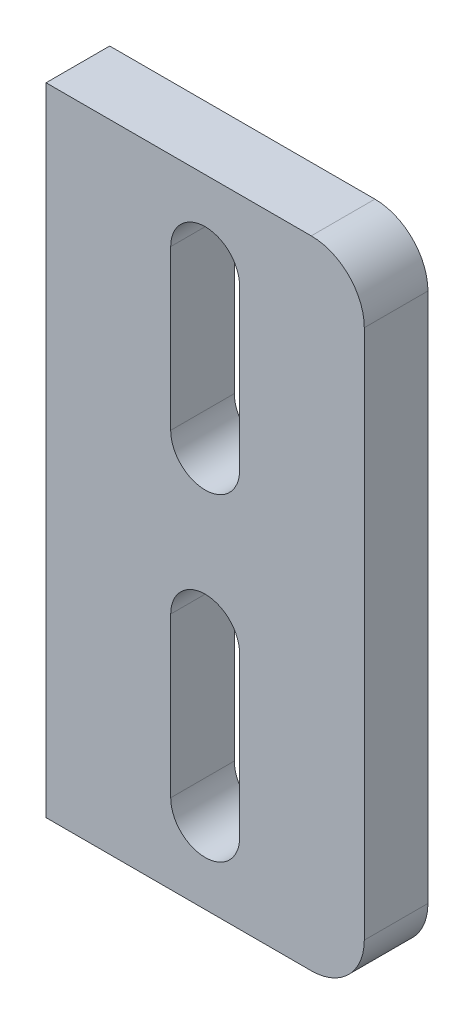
ISO-10303-21;
HEADER;
FILE_DESCRIPTION(('STEP AP214'),'2;1');
FILE_NAME('part.step','',(''),(''),'','','');
FILE_SCHEMA(('AUTOMOTIVE_DESIGN { 1 0 10303 214 1 1 1 1 }'));
ENDSEC;
DATA;
#1=APPLICATION_CONTEXT('core data for automotive mechanical design processes');
#2=APPLICATION_PROTOCOL_DEFINITION('international standard','automotive_design',2000,#1);
#3=PRODUCT_CONTEXT('',#1,'mechanical');
#4=PRODUCT('Part','Part','',(#3));
#5=PRODUCT_RELATED_PRODUCT_CATEGORY('part','',(#4));
#6=PRODUCT_DEFINITION_FORMATION('','',#4);
#7=PRODUCT_DEFINITION_CONTEXT('part definition',#1,'design');
#8=PRODUCT_DEFINITION('design','',#6,#7);
#9=PRODUCT_DEFINITION_SHAPE('','',#8);
#10=(LENGTH_UNIT() NAMED_UNIT(*) SI_UNIT(.MILLI.,.METRE.));
#11=(NAMED_UNIT(*) PLANE_ANGLE_UNIT() SI_UNIT($,.RADIAN.));
#12=(NAMED_UNIT(*) SI_UNIT($,.STERADIAN.) SOLID_ANGLE_UNIT());
#13=UNCERTAINTY_MEASURE_WITH_UNIT(LENGTH_MEASURE(1.E-05),#10,'distance_accuracy_value','');
#14=(GEOMETRIC_REPRESENTATION_CONTEXT(3) GLOBAL_UNCERTAINTY_ASSIGNED_CONTEXT((#13)) GLOBAL_UNIT_ASSIGNED_CONTEXT((#10,
#11,#12)) REPRESENTATION_CONTEXT('',''));
#15=CARTESIAN_POINT('',(0.,0.,0.));
#16=DIRECTION('',(0.,0.,1.));
#17=DIRECTION('',(1.,0.,0.));
#18=AXIS2_PLACEMENT_3D('',#15,#16,#17);
#19=CARTESIAN_POINT('',(20.,-50.,-12.));
#20=DIRECTION('',(0.,0.,1.));
#21=DIRECTION('',(1.,0.,0.));
#22=AXIS2_PLACEMENT_3D('',#19,#20,#21);
#23=CYLINDRICAL_SURFACE('',#22,9.99999999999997);
#24=CARTESIAN_POINT('',(20.,-50.,0.));
#25=DIRECTION('',(0.,0.,1.));
#26=DIRECTION('',(1.,0.,0.));
#27=AXIS2_PLACEMENT_3D('',#24,#25,#26);
#28=CIRCLE('',#27,9.99999999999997);
#29=CARTESIAN_POINT('',(20.,-60.0000000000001,0.));
#30=VERTEX_POINT('',#29);
#31=CARTESIAN_POINT('',(29.9999999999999,-49.9999999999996,0.));
#32=VERTEX_POINT('',#31);
#33=EDGE_CURVE('E214',#30,#32,#28,.T.);
#34=ORIENTED_EDGE('',*,*,#33,.F.);
#35=DIRECTION('',(0.,0.,1.));
#36=VECTOR('',#35,1.);
#37=CARTESIAN_POINT('',(20.,-60.0000000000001,-12.));
#38=LINE('',#37,#36);
#39=CARTESIAN_POINT('',(20.,-60.0000000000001,-12.));
#40=VERTEX_POINT('',#39);
#41=EDGE_CURVE('E11',#40,#30,#38,.T.);
#42=ORIENTED_EDGE('',*,*,#41,.F.);
#43=CARTESIAN_POINT('',(20.,-50.,-12.));
#44=DIRECTION('',(0.,0.,1.));
#45=DIRECTION('',(1.,0.,0.));
#46=AXIS2_PLACEMENT_3D('',#43,#44,#45);
#47=CIRCLE('',#46,9.99999999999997);
#48=CARTESIAN_POINT('',(29.9999999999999,-49.9999999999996,-12.));
#49=VERTEX_POINT('',#48);
#50=EDGE_CURVE('E221',#40,#49,#47,.T.);
#51=ORIENTED_EDGE('',*,*,#50,.T.);
#52=DIRECTION('',(0.,0.,1.));
#53=VECTOR('',#52,1.);
#54=CARTESIAN_POINT('',(29.9999999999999,-49.9999999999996,-12.));
#55=LINE('',#54,#53);
#56=EDGE_CURVE('E50',#49,#32,#55,.T.);
#57=ORIENTED_EDGE('',*,*,#56,.T.);
#58=EDGE_LOOP('',(#34,#42,#51,#57));
#59=FACE_BOUND('',#58,.T.);
#60=ADVANCED_FACE('F47',(#59),#23,.T.);
#61=CARTESIAN_POINT('',(-29.9999999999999,-60.0000000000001,-12.));
#62=DIRECTION('',(0.,-1.,0.));
#63=DIRECTION('',(0.,0.,-1.));
#64=AXIS2_PLACEMENT_3D('',#61,#62,#63);
#65=PLANE('',#64);
#66=DIRECTION('',(1.,0.,0.));
#67=VECTOR('',#66,1.);
#68=CARTESIAN_POINT('',(-29.9999999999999,-60.0000000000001,0.));
#69=LINE('',#68,#67);
#70=CARTESIAN_POINT('',(-29.9999999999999,-60.0000000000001,0.));
#71=VERTEX_POINT('',#70);
#72=EDGE_CURVE('E225',#71,#30,#69,.T.);
#73=ORIENTED_EDGE('',*,*,#72,.F.);
#74=DIRECTION('',(0.,0.,1.));
#75=VECTOR('',#74,1.);
#76=CARTESIAN_POINT('',(-29.9999999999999,-60.0000000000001,-12.));
#77=LINE('',#76,#75);
#78=CARTESIAN_POINT('',(-29.9999999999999,-60.0000000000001,-12.));
#79=VERTEX_POINT('',#78);
#80=EDGE_CURVE('E55',#79,#71,#77,.T.);
#81=ORIENTED_EDGE('',*,*,#80,.F.);
#82=DIRECTION('',(1.,0.,0.));
#83=VECTOR('',#82,1.);
#84=CARTESIAN_POINT('',(-29.9999999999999,-60.0000000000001,-12.));
#85=LINE('',#84,#83);
#86=EDGE_CURVE('E237',#79,#40,#85,.T.);
#87=ORIENTED_EDGE('',*,*,#86,.T.);
#88=ORIENTED_EDGE('',*,*,#41,.T.);
#89=EDGE_LOOP('',(#73,#81,#87,#88));
#90=FACE_BOUND('',#89,.T.);
#91=ADVANCED_FACE('F275',(#90),#65,.T.);
#92=CARTESIAN_POINT('',(-30.,60.0000000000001,-12.));
#93=DIRECTION('',(-1.,0.,0.));
#94=DIRECTION('',(0.,-1.,0.));
#95=AXIS2_PLACEMENT_3D('',#92,#93,#94);
#96=PLANE('',#95);
#97=DIRECTION('',(0.,-1.,0.));
#98=VECTOR('',#97,1.);
#99=CARTESIAN_POINT('',(-30.,60.0000000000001,0.));
#100=LINE('',#99,#98);
#101=CARTESIAN_POINT('',(-30.,60.0000000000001,0.));
#102=VERTEX_POINT('',#101);
#103=EDGE_CURVE('E252',#102,#71,#100,.T.);
#104=ORIENTED_EDGE('',*,*,#103,.F.);
#105=DIRECTION('',(0.,0.,1.));
#106=VECTOR('',#105,1.);
#107=CARTESIAN_POINT('',(-30.,60.0000000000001,-12.));
#108=LINE('',#107,#106);
#109=CARTESIAN_POINT('',(-30.,60.0000000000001,-12.));
#110=VERTEX_POINT('',#109);
#111=EDGE_CURVE('E258',#110,#102,#108,.T.);
#112=ORIENTED_EDGE('',*,*,#111,.F.);
#113=DIRECTION('',(0.,-1.,0.));
#114=VECTOR('',#113,1.);
#115=CARTESIAN_POINT('',(-30.,60.0000000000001,-12.));
#116=LINE('',#115,#114);
#117=EDGE_CURVE('E234',#110,#79,#116,.T.);
#118=ORIENTED_EDGE('',*,*,#117,.T.);
#119=ORIENTED_EDGE('',*,*,#80,.T.);
#120=EDGE_LOOP('',(#104,#112,#118,#119));
#121=FACE_BOUND('',#120,.T.);
#122=ADVANCED_FACE('F287',(#121),#96,.T.);
#123=CARTESIAN_POINT('',(20.,60.0000000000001,-12.));
#124=DIRECTION('',(0.,1.,0.));
#125=DIRECTION('',(0.,0.,1.));
#126=AXIS2_PLACEMENT_3D('',#123,#124,#125);
#127=PLANE('',#126);
#128=DIRECTION('',(-1.,0.,0.));
#129=VECTOR('',#128,1.);
#130=CARTESIAN_POINT('',(20.,60.0000000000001,0.));
#131=LINE('',#130,#129);
#132=CARTESIAN_POINT('',(20.,60.,0.));
#133=VERTEX_POINT('',#132);
#134=EDGE_CURVE('E249',#133,#102,#131,.T.);
#135=ORIENTED_EDGE('',*,*,#134,.F.);
#136=DIRECTION('',(0.,0.,1.));
#137=VECTOR('',#136,1.);
#138=CARTESIAN_POINT('',(20.,60.,-12.));
#139=LINE('',#138,#137);
#140=CARTESIAN_POINT('',(20.,60.,-12.));
#141=VERTEX_POINT('',#140);
#142=EDGE_CURVE('E260',#141,#133,#139,.T.);
#143=ORIENTED_EDGE('',*,*,#142,.F.);
#144=DIRECTION('',(-1.,0.,0.));
#145=VECTOR('',#144,1.);
#146=CARTESIAN_POINT('',(20.,60.0000000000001,-12.));
#147=LINE('',#146,#145);
#148=EDGE_CURVE('E231',#141,#110,#147,.T.);
#149=ORIENTED_EDGE('',*,*,#148,.T.);
#150=ORIENTED_EDGE('',*,*,#111,.T.);
#151=EDGE_LOOP('',(#135,#143,#149,#150));
#152=FACE_BOUND('',#151,.T.);
#153=ADVANCED_FACE('F285',(#152),#127,.T.);
#154=CARTESIAN_POINT('',(20.,50.,-12.));
#155=DIRECTION('',(0.,0.,1.));
#156=DIRECTION('',(1.,0.,0.));
#157=AXIS2_PLACEMENT_3D('',#154,#155,#156);
#158=CYLINDRICAL_SURFACE('',#157,9.99999999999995);
#159=CARTESIAN_POINT('',(20.,50.,0.));
#160=DIRECTION('',(0.,0.,1.));
#161=DIRECTION('',(1.,0.,0.));
#162=AXIS2_PLACEMENT_3D('',#159,#160,#161);
#163=CIRCLE('',#162,9.99999999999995);
#164=CARTESIAN_POINT('',(29.9999999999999,50.,0.));
#165=VERTEX_POINT('',#164);
#166=EDGE_CURVE('E245',#165,#133,#163,.T.);
#167=ORIENTED_EDGE('',*,*,#166,.F.);
#168=DIRECTION('',(0.,0.,1.));
#169=VECTOR('',#168,1.);
#170=CARTESIAN_POINT('',(29.9999999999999,50.,-12.));
#171=LINE('',#170,#169);
#172=CARTESIAN_POINT('',(29.9999999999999,50.,-12.));
#173=VERTEX_POINT('',#172);
#174=EDGE_CURVE('E261',#173,#165,#171,.T.);
#175=ORIENTED_EDGE('',*,*,#174,.F.);
#176=CARTESIAN_POINT('',(20.,50.,-12.));
#177=DIRECTION('',(0.,0.,1.));
#178=DIRECTION('',(1.,0.,0.));
#179=AXIS2_PLACEMENT_3D('',#176,#177,#178);
#180=CIRCLE('',#179,9.99999999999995);
#181=EDGE_CURVE('E228',#173,#141,#180,.T.);
#182=ORIENTED_EDGE('',*,*,#181,.T.);
#183=ORIENTED_EDGE('',*,*,#142,.T.);
#184=EDGE_LOOP('',(#167,#175,#182,#183));
#185=FACE_BOUND('',#184,.T.);
#186=ADVANCED_FACE('F282',(#185),#158,.T.);
#187=CARTESIAN_POINT('',(29.9999999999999,-49.9999999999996,-12.));
#188=DIRECTION('',(1.,0.,0.));
#189=DIRECTION('',(0.,1.,0.));
#190=AXIS2_PLACEMENT_3D('',#187,#188,#189);
#191=PLANE('',#190);
#192=DIRECTION('',(0.,1.,0.));
#193=VECTOR('',#192,1.);
#194=CARTESIAN_POINT('',(29.9999999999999,-49.9999999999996,0.));
#195=LINE('',#194,#193);
#196=EDGE_CURVE('E242',#32,#165,#195,.T.);
#197=ORIENTED_EDGE('',*,*,#196,.F.);
#198=ORIENTED_EDGE('',*,*,#56,.F.);
#199=DIRECTION('',(0.,1.,0.));
#200=VECTOR('',#199,1.);
#201=CARTESIAN_POINT('',(29.9999999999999,-49.9999999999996,-12.));
#202=LINE('',#201,#200);
#203=EDGE_CURVE('E224',#49,#173,#202,.T.);
#204=ORIENTED_EDGE('',*,*,#203,.T.);
#205=ORIENTED_EDGE('',*,*,#174,.T.);
#206=EDGE_LOOP('',(#197,#198,#204,#205));
#207=FACE_BOUND('',#206,.T.);
#208=ADVANCED_FACE('F269',(#207),#191,.T.);
#209=CARTESIAN_POINT('',(20.,-50.,-12.));
#210=DIRECTION('',(0.,0.,1.));
#211=DIRECTION('',(1.,0.,0.));
#212=AXIS2_PLACEMENT_3D('',#209,#210,#211);
#213=PLANE('',#212);
#214=DIRECTION('',(0.,1.,0.));
#215=VECTOR('',#214,1.);
#216=CARTESIAN_POINT('',(6.50000000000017,-44.9999999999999,-12.));
#217=LINE('',#216,#215);
#218=CARTESIAN_POINT('',(6.50000000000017,-44.9999999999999,-12.));
#219=VERTEX_POINT('',#218);
#220=CARTESIAN_POINT('',(6.50000000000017,-15.0000000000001,-12.));
#221=VERTEX_POINT('',#220);
#222=EDGE_CURVE('E157',#219,#221,#217,.T.);
#223=ORIENTED_EDGE('',*,*,#222,.T.);
#224=CARTESIAN_POINT('',(0.,-15.0000000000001,-12.));
#225=DIRECTION('',(0.,0.,1.));
#226=DIRECTION('',(1.,0.,0.));
#227=AXIS2_PLACEMENT_3D('',#224,#225,#226);
#228=CIRCLE('',#227,6.50000000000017);
#229=CARTESIAN_POINT('',(-6.50000000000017,-15.0000000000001,-12.));
#230=VERTEX_POINT('',#229);
#231=EDGE_CURVE('E151',#221,#230,#228,.T.);
#232=ORIENTED_EDGE('',*,*,#231,.T.);
#233=DIRECTION('',(0.,-1.,0.));
#234=VECTOR('',#233,1.);
#235=CARTESIAN_POINT('',(-6.50000000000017,-15.0000000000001,-12.));
#236=LINE('',#235,#234);
#237=CARTESIAN_POINT('',(-6.50000000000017,-44.9999999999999,-12.));
#238=VERTEX_POINT('',#237);
#239=EDGE_CURVE('E160',#230,#238,#236,.T.);
#240=ORIENTED_EDGE('',*,*,#239,.T.);
#241=CARTESIAN_POINT('',(0.,-44.9999999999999,-12.));
#242=DIRECTION('',(0.,0.,1.));
#243=DIRECTION('',(1.,0.,0.));
#244=AXIS2_PLACEMENT_3D('',#241,#242,#243);
#245=CIRCLE('',#244,6.50000000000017);
#246=EDGE_CURVE('E63',#238,#219,#245,.T.);
#247=ORIENTED_EDGE('',*,*,#246,.T.);
#248=EDGE_LOOP('',(#223,#232,#240,#247));
#249=FACE_BOUND('',#248,.T.);
#250=DIRECTION('',(0.,1.,0.));
#251=VECTOR('',#250,1.);
#252=CARTESIAN_POINT('',(6.50000000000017,15.0000000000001,-12.));
#253=LINE('',#252,#251);
#254=CARTESIAN_POINT('',(6.50000000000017,15.0000000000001,-12.));
#255=VERTEX_POINT('',#254);
#256=CARTESIAN_POINT('',(6.50000000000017,44.9999999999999,-12.));
#257=VERTEX_POINT('',#256);
#258=EDGE_CURVE('E197',#255,#257,#253,.T.);
#259=ORIENTED_EDGE('',*,*,#258,.T.);
#260=CARTESIAN_POINT('',(0.,44.9999999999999,-12.));
#261=DIRECTION('',(0.,0.,1.));
#262=DIRECTION('',(1.,0.,0.));
#263=AXIS2_PLACEMENT_3D('',#260,#261,#262);
#264=CIRCLE('',#263,6.50000000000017);
#265=CARTESIAN_POINT('',(-6.50000000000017,44.9999999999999,-12.));
#266=VERTEX_POINT('',#265);
#267=EDGE_CURVE('E186',#257,#266,#264,.T.);
#268=ORIENTED_EDGE('',*,*,#267,.T.);
#269=DIRECTION('',(0.,-1.,0.));
#270=VECTOR('',#269,1.);
#271=CARTESIAN_POINT('',(-6.50000000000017,44.9999999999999,-12.));
#272=LINE('',#271,#270);
#273=CARTESIAN_POINT('',(-6.50000000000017,15.0000000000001,-12.));
#274=VERTEX_POINT('',#273);
#275=EDGE_CURVE('E190',#266,#274,#272,.T.);
#276=ORIENTED_EDGE('',*,*,#275,.T.);
#277=CARTESIAN_POINT('',(0.,15.0000000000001,-12.));
#278=DIRECTION('',(0.,0.,1.));
#279=DIRECTION('',(1.,0.,0.));
#280=AXIS2_PLACEMENT_3D('',#277,#278,#279);
#281=CIRCLE('',#280,6.50000000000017);
#282=EDGE_CURVE('E194',#274,#255,#281,.T.);
#283=ORIENTED_EDGE('',*,*,#282,.T.);
#284=EDGE_LOOP('',(#259,#268,#276,#283));
#285=FACE_BOUND('',#284,.T.);
#286=ORIENTED_EDGE('',*,*,#50,.F.);
#287=ORIENTED_EDGE('',*,*,#86,.F.);
#288=ORIENTED_EDGE('',*,*,#117,.F.);
#289=ORIENTED_EDGE('',*,*,#148,.F.);
#290=ORIENTED_EDGE('',*,*,#181,.F.);
#291=ORIENTED_EDGE('',*,*,#203,.F.);
#292=EDGE_LOOP('',(#286,#287,#288,#289,#290,#291));
#293=FACE_BOUND('',#292,.T.);
#294=ADVANCED_FACE('F164',(#249,#285,#293),#213,.F.);
#295=CARTESIAN_POINT('',(20.,-50.,0.));
#296=DIRECTION('',(0.,0.,1.));
#297=DIRECTION('',(1.,0.,0.));
#298=AXIS2_PLACEMENT_3D('',#295,#296,#297);
#299=PLANE('',#298);
#300=CARTESIAN_POINT('',(0.,-15.0000000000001,0.));
#301=DIRECTION('',(0.,0.,1.));
#302=DIRECTION('',(1.,0.,0.));
#303=AXIS2_PLACEMENT_3D('',#300,#301,#302);
#304=CIRCLE('',#303,6.50000000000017);
#305=CARTESIAN_POINT('',(6.50000000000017,-15.0000000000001,0.));
#306=VERTEX_POINT('',#305);
#307=CARTESIAN_POINT('',(-6.50000000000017,-15.0000000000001,0.));
#308=VERTEX_POINT('',#307);
#309=EDGE_CURVE('E71',#306,#308,#304,.T.);
#310=ORIENTED_EDGE('',*,*,#309,.F.);
#311=DIRECTION('',(0.,1.,0.));
#312=VECTOR('',#311,1.);
#313=CARTESIAN_POINT('',(6.50000000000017,-44.9999999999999,0.));
#314=LINE('',#313,#312);
#315=CARTESIAN_POINT('',(6.50000000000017,-44.9999999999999,0.));
#316=VERTEX_POINT('',#315);
#317=EDGE_CURVE('E167',#316,#306,#314,.T.);
#318=ORIENTED_EDGE('',*,*,#317,.F.);
#319=CARTESIAN_POINT('',(0.,-44.9999999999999,0.));
#320=DIRECTION('',(0.,0.,1.));
#321=DIRECTION('',(1.,0.,0.));
#322=AXIS2_PLACEMENT_3D('',#319,#320,#321);
#323=CIRCLE('',#322,6.50000000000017);
#324=CARTESIAN_POINT('',(-6.50000000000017,-44.9999999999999,0.));
#325=VERTEX_POINT('',#324);
#326=EDGE_CURVE('E170',#325,#316,#323,.T.);
#327=ORIENTED_EDGE('',*,*,#326,.F.);
#328=DIRECTION('',(0.,-1.,0.));
#329=VECTOR('',#328,1.);
#330=CARTESIAN_POINT('',(-6.50000000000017,-15.0000000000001,0.));
#331=LINE('',#330,#329);
#332=EDGE_CURVE('E176',#308,#325,#331,.T.);
#333=ORIENTED_EDGE('',*,*,#332,.F.);
#334=EDGE_LOOP('',(#310,#318,#327,#333));
#335=FACE_BOUND('',#334,.T.);
#336=CARTESIAN_POINT('',(0.,44.9999999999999,0.));
#337=DIRECTION('',(0.,0.,1.));
#338=DIRECTION('',(1.,0.,0.));
#339=AXIS2_PLACEMENT_3D('',#336,#337,#338);
#340=CIRCLE('',#339,6.50000000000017);
#341=CARTESIAN_POINT('',(6.50000000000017,44.9999999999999,0.));
#342=VERTEX_POINT('',#341);
#343=CARTESIAN_POINT('',(-6.50000000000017,44.9999999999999,0.));
#344=VERTEX_POINT('',#343);
#345=EDGE_CURVE('E182',#342,#344,#340,.T.);
#346=ORIENTED_EDGE('',*,*,#345,.F.);
#347=DIRECTION('',(0.,1.,0.));
#348=VECTOR('',#347,1.);
#349=CARTESIAN_POINT('',(6.50000000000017,15.0000000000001,0.));
#350=LINE('',#349,#348);
#351=CARTESIAN_POINT('',(6.50000000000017,15.0000000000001,0.));
#352=VERTEX_POINT('',#351);
#353=EDGE_CURVE('E191',#352,#342,#350,.T.);
#354=ORIENTED_EDGE('',*,*,#353,.F.);
#355=CARTESIAN_POINT('',(0.,15.0000000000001,0.));
#356=DIRECTION('',(0.,0.,1.));
#357=DIRECTION('',(1.,0.,0.));
#358=AXIS2_PLACEMENT_3D('',#355,#356,#357);
#359=CIRCLE('',#358,6.50000000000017);
#360=CARTESIAN_POINT('',(-6.50000000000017,15.0000000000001,0.));
#361=VERTEX_POINT('',#360);
#362=EDGE_CURVE('E206',#361,#352,#359,.T.);
#363=ORIENTED_EDGE('',*,*,#362,.F.);
#364=DIRECTION('',(0.,-1.,0.));
#365=VECTOR('',#364,1.);
#366=CARTESIAN_POINT('',(-6.50000000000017,44.9999999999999,0.));
#367=LINE('',#366,#365);
#368=EDGE_CURVE('E203',#344,#361,#367,.T.);
#369=ORIENTED_EDGE('',*,*,#368,.F.);
#370=EDGE_LOOP('',(#346,#354,#363,#369));
#371=FACE_BOUND('',#370,.T.);
#372=ORIENTED_EDGE('',*,*,#33,.T.);
#373=ORIENTED_EDGE('',*,*,#196,.T.);
#374=ORIENTED_EDGE('',*,*,#166,.T.);
#375=ORIENTED_EDGE('',*,*,#134,.T.);
#376=ORIENTED_EDGE('',*,*,#103,.T.);
#377=ORIENTED_EDGE('',*,*,#72,.T.);
#378=EDGE_LOOP('',(#372,#373,#374,#375,#376,#377));
#379=FACE_BOUND('',#378,.T.);
#380=ADVANCED_FACE('F271',(#335,#371,#379),#299,.T.);
#381=CARTESIAN_POINT('',(0.,44.9999999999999,-12.));
#382=DIRECTION('',(0.,0.,1.));
#383=DIRECTION('',(1.,0.,0.));
#384=AXIS2_PLACEMENT_3D('',#381,#382,#383);
#385=CYLINDRICAL_SURFACE('',#384,6.50000000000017);
#386=ORIENTED_EDGE('',*,*,#345,.T.);
#387=DIRECTION('',(0.,0.,1.));
#388=VECTOR('',#387,1.);
#389=CARTESIAN_POINT('',(-6.50000000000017,44.9999999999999,-12.));
#390=LINE('',#389,#388);
#391=EDGE_CURVE('E201',#266,#344,#390,.T.);
#392=ORIENTED_EDGE('',*,*,#391,.F.);
#393=ORIENTED_EDGE('',*,*,#267,.F.);
#394=DIRECTION('',(0.,0.,1.));
#395=VECTOR('',#394,1.);
#396=CARTESIAN_POINT('',(6.50000000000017,44.9999999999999,-12.));
#397=LINE('',#396,#395);
#398=EDGE_CURVE('E211',#257,#342,#397,.T.);
#399=ORIENTED_EDGE('',*,*,#398,.T.);
#400=EDGE_LOOP('',(#386,#392,#393,#399));
#401=FACE_BOUND('',#400,.T.);
#402=ADVANCED_FACE('F355',(#401),#385,.F.);
#403=CARTESIAN_POINT('',(6.50000000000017,15.0000000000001,-12.));
#404=DIRECTION('',(1.,0.,0.));
#405=DIRECTION('',(0.,0.,-1.));
#406=AXIS2_PLACEMENT_3D('',#403,#404,#405);
#407=PLANE('',#406);
#408=ORIENTED_EDGE('',*,*,#353,.T.);
#409=ORIENTED_EDGE('',*,*,#398,.F.);
#410=ORIENTED_EDGE('',*,*,#258,.F.);
#411=DIRECTION('',(0.,0.,1.));
#412=VECTOR('',#411,1.);
#413=CARTESIAN_POINT('',(6.50000000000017,15.0000000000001,-12.));
#414=LINE('',#413,#412);
#415=EDGE_CURVE('E215',#255,#352,#414,.T.);
#416=ORIENTED_EDGE('',*,*,#415,.T.);
#417=EDGE_LOOP('',(#408,#409,#410,#416));
#418=FACE_BOUND('',#417,.T.);
#419=ADVANCED_FACE('F366',(#418),#407,.F.);
#420=CARTESIAN_POINT('',(0.,15.0000000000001,-12.));
#421=DIRECTION('',(0.,0.,1.));
#422=DIRECTION('',(1.,0.,0.));
#423=AXIS2_PLACEMENT_3D('',#420,#421,#422);
#424=CYLINDRICAL_SURFACE('',#423,6.50000000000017);
#425=ORIENTED_EDGE('',*,*,#362,.T.);
#426=ORIENTED_EDGE('',*,*,#415,.F.);
#427=ORIENTED_EDGE('',*,*,#282,.F.);
#428=DIRECTION('',(0.,0.,1.));
#429=VECTOR('',#428,1.);
#430=CARTESIAN_POINT('',(-6.50000000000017,15.0000000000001,-12.));
#431=LINE('',#430,#429);
#432=EDGE_CURVE('E217',#274,#361,#431,.T.);
#433=ORIENTED_EDGE('',*,*,#432,.T.);
#434=EDGE_LOOP('',(#425,#426,#427,#433));
#435=FACE_BOUND('',#434,.T.);
#436=ADVANCED_FACE('F377',(#435),#424,.F.);
#437=CARTESIAN_POINT('',(-6.50000000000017,44.9999999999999,-12.));
#438=DIRECTION('',(-1.,0.,0.));
#439=DIRECTION('',(0.,0.,1.));
#440=AXIS2_PLACEMENT_3D('',#437,#438,#439);
#441=PLANE('',#440);
#442=ORIENTED_EDGE('',*,*,#368,.T.);
#443=ORIENTED_EDGE('',*,*,#432,.F.);
#444=ORIENTED_EDGE('',*,*,#275,.F.);
#445=ORIENTED_EDGE('',*,*,#391,.T.);
#446=EDGE_LOOP('',(#442,#443,#444,#445));
#447=FACE_BOUND('',#446,.T.);
#448=ADVANCED_FACE('F388',(#447),#441,.F.);
#449=CARTESIAN_POINT('',(0.,-15.0000000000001,-12.));
#450=DIRECTION('',(0.,0.,1.));
#451=DIRECTION('',(1.,0.,0.));
#452=AXIS2_PLACEMENT_3D('',#449,#450,#451);
#453=CYLINDRICAL_SURFACE('',#452,6.50000000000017);
#454=ORIENTED_EDGE('',*,*,#309,.T.);
#455=DIRECTION('',(0.,0.,1.));
#456=VECTOR('',#455,1.);
#457=CARTESIAN_POINT('',(-6.50000000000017,-15.0000000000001,-12.));
#458=LINE('',#457,#456);
#459=EDGE_CURVE('E147',#230,#308,#458,.T.);
#460=ORIENTED_EDGE('',*,*,#459,.F.);
#461=ORIENTED_EDGE('',*,*,#231,.F.);
#462=DIRECTION('',(0.,0.,1.));
#463=VECTOR('',#462,1.);
#464=CARTESIAN_POINT('',(6.50000000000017,-15.0000000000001,-12.));
#465=LINE('',#464,#463);
#466=EDGE_CURVE('E180',#221,#306,#465,.T.);
#467=ORIENTED_EDGE('',*,*,#466,.T.);
#468=EDGE_LOOP('',(#454,#460,#461,#467));
#469=FACE_BOUND('',#468,.T.);
#470=ADVANCED_FACE('F149',(#469),#453,.F.);
#471=CARTESIAN_POINT('',(6.50000000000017,-44.9999999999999,-12.));
#472=DIRECTION('',(1.,0.,0.));
#473=DIRECTION('',(0.,0.,-1.));
#474=AXIS2_PLACEMENT_3D('',#471,#472,#473);
#475=PLANE('',#474);
#476=ORIENTED_EDGE('',*,*,#317,.T.);
#477=ORIENTED_EDGE('',*,*,#466,.F.);
#478=ORIENTED_EDGE('',*,*,#222,.F.);
#479=DIRECTION('',(0.,0.,1.));
#480=VECTOR('',#479,1.);
#481=CARTESIAN_POINT('',(6.50000000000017,-44.9999999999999,-12.));
#482=LINE('',#481,#480);
#483=EDGE_CURVE('E183',#219,#316,#482,.T.);
#484=ORIENTED_EDGE('',*,*,#483,.T.);
#485=EDGE_LOOP('',(#476,#477,#478,#484));
#486=FACE_BOUND('',#485,.T.);
#487=ADVANCED_FACE('F409',(#486),#475,.F.);
#488=CARTESIAN_POINT('',(0.,-44.9999999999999,-12.));
#489=DIRECTION('',(0.,0.,1.));
#490=DIRECTION('',(1.,0.,0.));
#491=AXIS2_PLACEMENT_3D('',#488,#489,#490);
#492=CYLINDRICAL_SURFACE('',#491,6.50000000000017);
#493=ORIENTED_EDGE('',*,*,#326,.T.);
#494=ORIENTED_EDGE('',*,*,#483,.F.);
#495=ORIENTED_EDGE('',*,*,#246,.F.);
#496=DIRECTION('',(0.,0.,1.));
#497=VECTOR('',#496,1.);
#498=CARTESIAN_POINT('',(-6.50000000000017,-44.9999999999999,-12.));
#499=LINE('',#498,#497);
#500=EDGE_CURVE('E156',#238,#325,#499,.T.);
#501=ORIENTED_EDGE('',*,*,#500,.T.);
#502=EDGE_LOOP('',(#493,#494,#495,#501));
#503=FACE_BOUND('',#502,.T.);
#504=ADVANCED_FACE('F419',(#503),#492,.F.);
#505=CARTESIAN_POINT('',(-6.50000000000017,-15.0000000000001,-12.));
#506=DIRECTION('',(-1.,0.,0.));
#507=DIRECTION('',(0.,0.,1.));
#508=AXIS2_PLACEMENT_3D('',#505,#506,#507);
#509=PLANE('',#508);
#510=ORIENTED_EDGE('',*,*,#332,.T.);
#511=ORIENTED_EDGE('',*,*,#500,.F.);
#512=ORIENTED_EDGE('',*,*,#239,.F.);
#513=ORIENTED_EDGE('',*,*,#459,.T.);
#514=EDGE_LOOP('',(#510,#511,#512,#513));
#515=FACE_BOUND('',#514,.T.);
#516=ADVANCED_FACE('F161',(#515),#509,.F.);
#517=CLOSED_SHELL('',(#60,#91,#122,#153,#186,#208,#294,#380,#402,#419,#436,#448,#470,#487,#504,#516));
#518=MANIFOLD_SOLID_BREP('B2',#517);
#519=ADVANCED_BREP_SHAPE_REPRESENTATION('',(#18,#518),#14);
#520=SHAPE_DEFINITION_REPRESENTATION(#9,#519);
ENDSEC;
END-ISO-10303-21;
